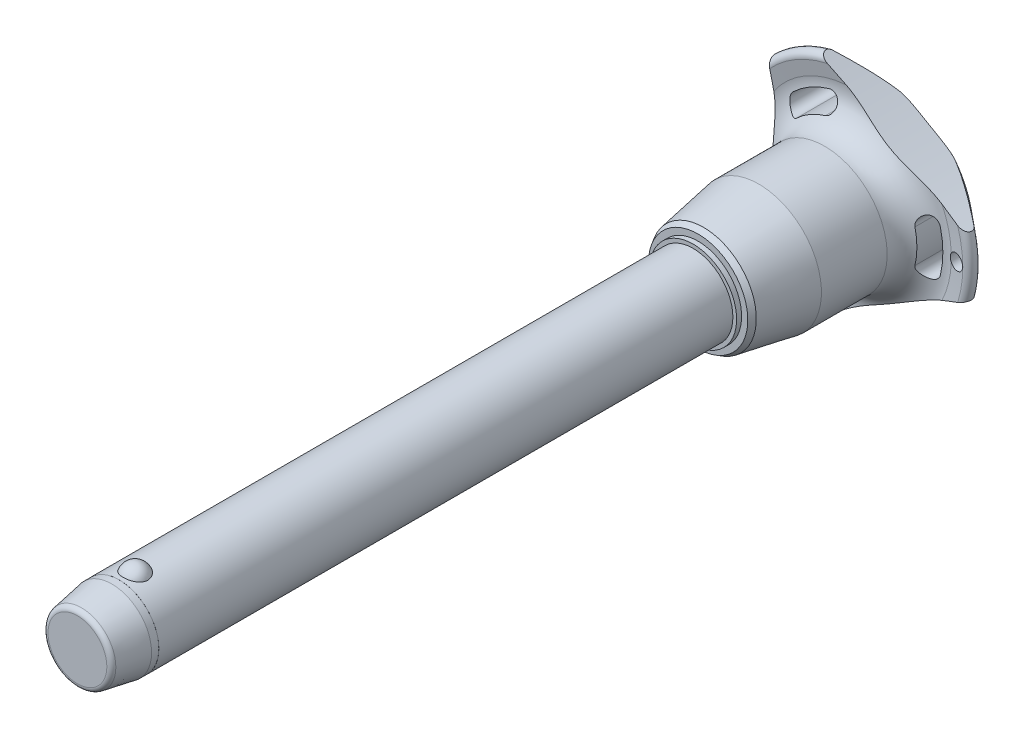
from build123d import *

# Parameters (mm, degrees)
SKETCH1_R           = 8
BOSS_EXTRUDE1_DEPTH = 110
SKETCH2_R           = 7
BOSS_EXTRUDE2_DEPTH = 39.7
BOSS_EXTRUDE3_START = 14
SKETCH1_2_R         = 8
BOSS_EXTRUDE3_DEPTH = 14
CHAMFER1_SIZE       = 7
CHAMFER1_SIZE2      = 1.234288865
FILLET1_R           = 1
SKETCH6_R           = 144.275
CUT_EXTRUDE1_DEPTH  = 154.440094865
CIRPATTERN1_COUNT   = 3
SKETCH7_R           = 1.5
CUT_EXTRUDE2_DEPTH  = 154.309245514
SKETCH8_R           = 8
SKETCH8_R_2         = 7.99
CUT_EXTRUDE3_DEPTH  = 8.4


with BuildPart() as part:
    # Sketch1 → Boss-Extrude1 (new body)
    with BuildSketch(Plane.XY):
        Circle(SKETCH1_R)
    extrude(amount=-BOSS_EXTRUDE1_DEPTH)

    # Sketch2 → Boss-Extrude2 (add)
    with BuildSketch(Plane(origin=(0, 0, -110), x_dir=(-1, 0, 0), z_dir=(0, 0, -1))):
        Circle(SKETCH2_R)
    extrude(amount=BOSS_EXTRUDE2_DEPTH)

    # Sketch3 → Revolve1 (revolve)
    with BuildSketch(Plane(origin=(0, 0, 0), x_dir=(0, 0, -1), z_dir=(1, 0, 0))):
        with BuildLine():
            Line((-2.387467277, 9.5), (-2.387467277, 4.2))
            ThreePointArc((-2.387467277, 4.2), (0.262532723, 6.85), (-2.387467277, 9.5))
        make_face()
        with BuildLine():
            Line((-2.387467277, -4.2), (-2.387467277, -9.5))
            ThreePointArc((-2.387467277, -9.5), (0.262532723, -6.85), (-2.387467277, -4.2))
        make_face()
    revolve(axis=Axis((0, -4.2, 2.387467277), (0, 1, 0)))

    # Sketch1_2 → Boss-Extrude3 (add)
    with BuildSketch(Plane.XY.offset(BOSS_EXTRUDE3_START)):
        Circle(SKETCH1_2_R)
    extrude(amount=-BOSS_EXTRUDE3_DEPTH)

    # Chamfer1
    chamfer1_edges = [part.edges().sort_by_distance(p)[0] for p in [
        (-8, 0, 14),
    ]]
    chamfer1_side = [part.faces().sort_by_distance(p)[0] for p in [
        (-8, 0, -48),
    ]]
    chamfer(chamfer1_edges, length=CHAMFER1_SIZE, length2=CHAMFER1_SIZE2, reference=chamfer1_side[0])

    # Fillet1
    fillet1_edges = [part.edges().sort_by_distance(p)[0] for p in [
        (-6.765711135, 0, 14),
        (7, 0, -149.7),
    ]]
    fillet(fillet1_edges, radius=FILLET1_R)

    # Sketch4 → Revolve2 (revolve)
    with BuildSketch(Plane(origin=(0, 0, 0), x_dir=(0, 0, -1), z_dir=(1, 0, 0)), mode=Mode.PRIVATE) as revolve2_sk:
        Polygon((110, 0), (110, 8.754868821), (111, 8.754868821), (111, 10.007796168), (112.085066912, 10.634259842), (123.233333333, 12.6), (136.466666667, 12.6), (136.466666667, 0), align=None)
    revolve(revolve2_sk.sketch.rotate(Axis((0, 0, -136.466666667), (0, 0, 1)), 90), axis=Axis((0, 0, -136.466666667), (0, 0, 1)))

    # Sketch5 → Revolve3 (revolve)
    with BuildSketch(Plane(origin=(0, 0, 0), x_dir=(0, 0, -1), z_dir=(1, 0, 0)), mode=Mode.PRIVATE) as revolve3_sk:
        with BuildLine():
            Line((142.379459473, 19.619255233), (141.900774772, 22.396148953))
            ThreePointArc((141.900774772, 22.396148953), (142.578274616, 23.688538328), (144.002586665, 23.371345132))
            Line((144.002586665, 23.371345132), (149.141488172, 17.247040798))
            ThreePointArc((149.141488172, 17.247040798), (149.7, 15.584758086), (148.978803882, 13.986322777))
            ThreePointArc((148.978803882, 13.986322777), (144.617427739, 7.589034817), (143.083333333, 0))
            Line((143.083333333, 0), (136.466666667, 0))
            Line((136.466666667, 0), (136.466666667, 12.6))
            ThreePointArc((136.466666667, 12.6), (141.055540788, 14.734481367), (142.379459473, 19.619255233))
        make_face()
    revolve(revolve3_sk.sketch.rotate(Axis((0, 0, -143.083333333), (0, 0, 1)), 90), axis=Axis((0, 0, -143.083333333), (0, 0, 1)))

    # Sketch6 → Cut-Extrude1 (cut, through all)
    with BuildSketch(Plane.XY):
        with Locations((-159.975, 0)):
            Circle(SKETCH6_R)
        with BuildLine():
            ThreePointArc((17.365443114, -4.192809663), (17.864441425, 0), (17.365443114, 4.192809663))
            ThreePointArc((17.365443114, 4.192809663), (15.247788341, 5.486749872), (13.953848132, 3.369095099))
            ThreePointArc((13.953848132, 3.369095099), (14.354813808, 0), (13.953848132, -3.369095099))
            ThreePointArc((13.953848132, -3.369095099), (15.247788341, -5.486749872), (17.365443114, -4.192809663))
        make_face()
    cut_extrude1 = extrude(amount=-CUT_EXTRUDE1_DEPTH, mode=Mode.SUBTRACT)

    # CirPattern1: Cut-Extrude1 ×3 about axis
    cirpattern1_axis = Axis((0, 0, 0), (0, 0, 1))
    for i in range(1, CIRPATTERN1_COUNT):
        add(cut_extrude1.rotate(cirpattern1_axis, i * 360 / CIRPATTERN1_COUNT), mode=Mode.SUBTRACT)

    # Sketch7 → Cut-Extrude2 (cut, through all)
    with BuildSketch(Plane.XY):
        with Locations(Location((20.864441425, 0, 0), (0, 0, 221.008319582))):
            Circle(SKETCH7_R)
    extrude(amount=-CUT_EXTRUDE2_DEPTH, mode=Mode.SUBTRACT)

    # Sketch8 → Cut-Extrude3 (cut)
    with BuildSketch(Plane.XY.offset(14)):
        Circle(SKETCH8_R)
        Circle(SKETCH8_R_2, mode=Mode.SUBTRACT)
    extrude(amount=-CUT_EXTRUDE3_DEPTH, mode=Mode.SUBTRACT)


solid = part.part
